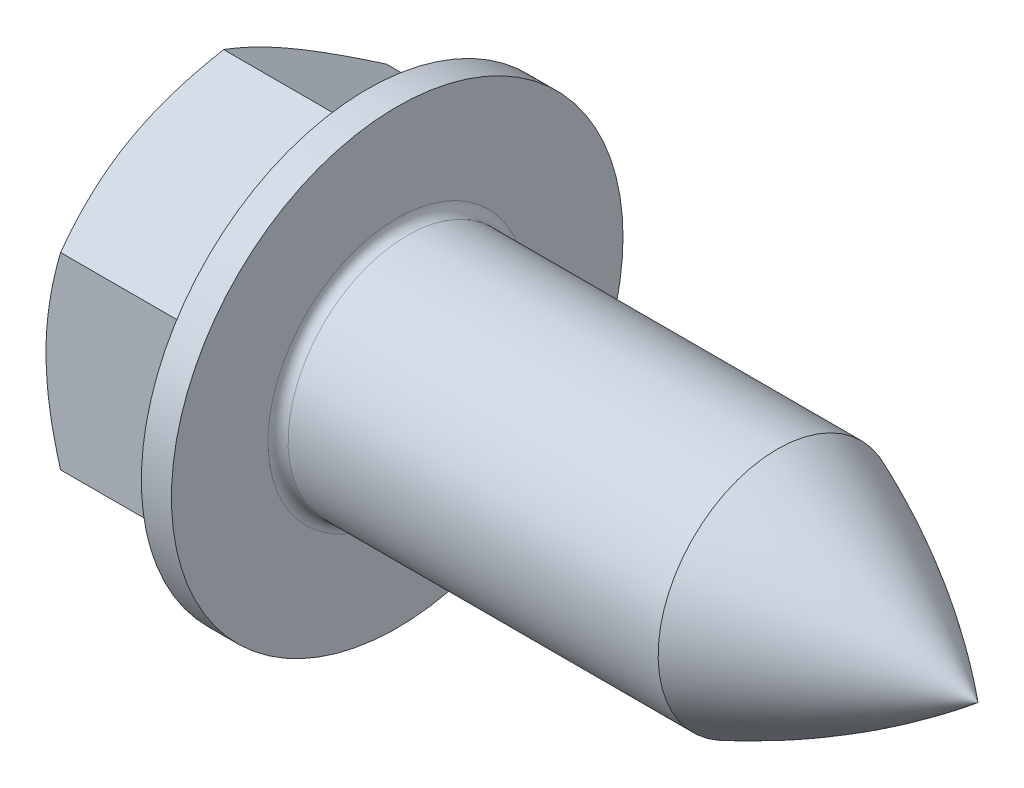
from build123d import *

# Parameters (mm, degrees)
BASEHEAD_DEPTH = 7.5
SKETCH1_W      = 23.15
SKETCH1_H      = 4.75
SKETCH3_R      = 9
NECK_DEPTH     = 1.2
FILLET1_R      = 0.4
FILLET2_R      = 0.6


with BuildPart() as part:
    # Sketch2 → BaseHead (new body)
    with BuildSketch(Plane(origin=(0, 0, 0), x_dir=(0, 0, -1), z_dir=(1, 0, 0))):
        Polygon((0, 7.505553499), (-6.5, 3.75277675), (-6.5, -3.75277675), (0, -7.505553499), (6.5, -3.75277675), (6.5, 3.75277675), align=None)
    extrude(amount=BASEHEAD_DEPTH)

    # Sketch1 → BaseBody (revolve)
    with BuildSketch(Plane.XY, mode=Mode.PRIVATE) as basebody_sk:
        with Locations((19.075, 2.375)):
            Rectangle(SKETCH1_W, SKETCH1_H)
    revolve(basebody_sk.sketch.rotate(Axis((-9.544470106, 0, 0), (1, 0, 0)), 90), axis=Axis((-9.544470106, 0, 0), (1, 0, 0)))

    # Sketch3 → Neck (add)
    with BuildSketch(Plane(origin=(7.5, -3.781678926, 4.212711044), x_dir=(0, 0, -1), z_dir=(1, 0, 0))):
        with Locations((4.212711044, 3.781678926)):
            Circle(SKETCH3_R)
    extrude(amount=-NECK_DEPTH)

    # Sketch4 → Cut-Revolve7 (revolve, cut)
    with BuildSketch(Plane.XY):
        Polygon((0, 6.5), (0.580556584, 7.505553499), (0, 7.505553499), align=None)
    revolve(axis=Axis((10.663764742, 0, 0), (-1, 0, 0)), mode=Mode.SUBTRACT)

    # Fillet1
    fillet1_edges = [part.edges().sort_by_distance(p)[0] for p in [
        (7.5, 0, -4.75),
    ]]
    fillet(fillet1_edges, radius=FILLET1_R)

    # Fillet2
    fillet2_edges = [part.edges().sort_by_distance(p)[0] for p in [
        (6.3, 0, -6.5),
        (6.3, 5.629165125, -3.25),
        (6.3, 5.629165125, 3.25),
        (6.3, 0, 6.5),
        (6.3, -5.629165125, 3.25),
        (6.3, -5.629165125, -3.25),
    ]]
    fillet(fillet2_edges, radius=FILLET2_R)

    # Sketch5 → Cut-Revolve1 (revolve, cut)
    with BuildSketch(Plane.XY, mode=Mode.PRIVATE) as cut_revolve1_sk:
        Polygon((26.45, -4.75), (28.55, -4.75), (30.65, -4.225), (30.65, -5.25), (26.45, -5.25), align=None)
    revolve(cut_revolve1_sk.sketch.rotate(Axis((31.978193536, 0, 0), (-1, 0, 0)), 180), axis=Axis((31.978193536, 0, 0), (-1, 0, 0)), mode=Mode.SUBTRACT)

    # Sketch6 → Cut-Revolve6 (revolve, cut)
    with BuildSketch(Plane.XY, mode=Mode.PRIVATE) as cut_revolve6_sk:
        with BuildLine():
            Line((30.65, 0), (31.15, 0))
            Line((31.15, 0), (31.15, -4.75))
            Line((31.15, -4.75), (30.65, -4.75))
            Line((30.65, -4.75), (22.65, -4.75))
            ThreePointArc((22.65, -4.75), (26.823552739, -2.66729935), (30.65, 0))
        make_face()
    revolve(cut_revolve6_sk.sketch.rotate(Axis((33.390663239, 0, 0), (-1, 0, 0)), 180), axis=Axis((33.390663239, 0, 0), (-1, 0, 0)), mode=Mode.SUBTRACT)

    # Sketch7 → Cut-Revolve8 (revolve, cut)
    with BuildSketch(Plane.XY, mode=Mode.PRIVATE) as cut_revolve8_sk:
        with BuildLine():
            Line((-0.1, 5.416666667), (0.9, 5.416666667))
            ThreePointArc((0.9, 5.416666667), (1.076776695, 5.343443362), (1.15, 5.166666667))
            Line((1.15, 5.166666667), (1.15, 0))
            Line((1.15, 0), (-0.1, 0))
            Line((-0.1, 0), (-0.1, 5.416666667))
        make_face()
    revolve(cut_revolve8_sk.sketch.rotate(Axis((0, 0, 0), (-1, 0, 0)), 90), axis=Axis((0, 0, 0), (-1, 0, 0)), mode=Mode.SUBTRACT)


solid = part.part
